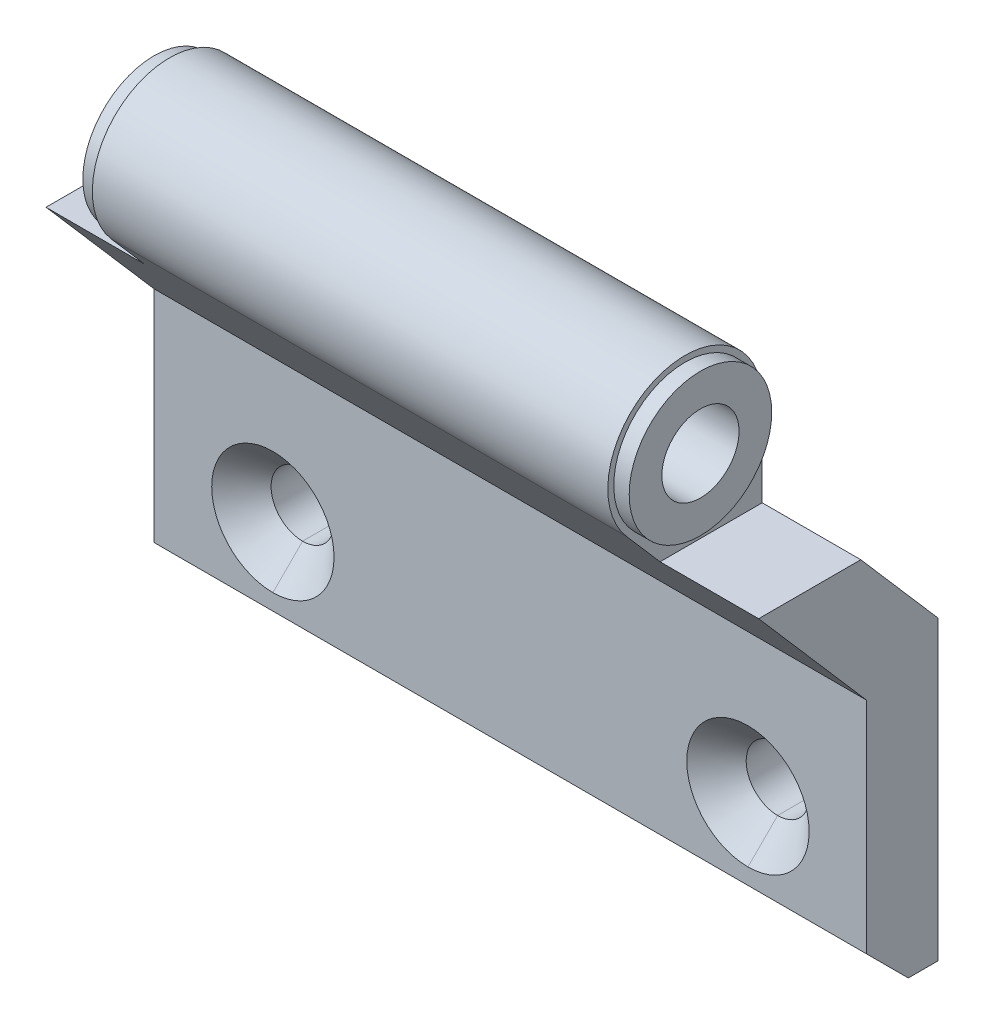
ISO-10303-21;
HEADER;
FILE_DESCRIPTION(('STEP AP214'),'2;1');
FILE_NAME('part.step','',(''),(''),'','','');
FILE_SCHEMA(('AUTOMOTIVE_DESIGN { 1 0 10303 214 1 1 1 1 }'));
ENDSEC;
DATA;
#1=APPLICATION_CONTEXT('core data for automotive mechanical design processes');
#2=APPLICATION_PROTOCOL_DEFINITION('international standard','automotive_design',2000,#1);
#3=PRODUCT_CONTEXT('',#1,'mechanical');
#4=PRODUCT('Part','Part','',(#3));
#5=PRODUCT_RELATED_PRODUCT_CATEGORY('part','',(#4));
#6=PRODUCT_DEFINITION_FORMATION('','',#4);
#7=PRODUCT_DEFINITION_CONTEXT('part definition',#1,'design');
#8=PRODUCT_DEFINITION('design','',#6,#7);
#9=PRODUCT_DEFINITION_SHAPE('','',#8);
#10=(LENGTH_UNIT() NAMED_UNIT(*) SI_UNIT(.MILLI.,.METRE.));
#11=(NAMED_UNIT(*) PLANE_ANGLE_UNIT() SI_UNIT($,.RADIAN.));
#12=(NAMED_UNIT(*) SI_UNIT($,.STERADIAN.) SOLID_ANGLE_UNIT());
#13=UNCERTAINTY_MEASURE_WITH_UNIT(LENGTH_MEASURE(1.E-05),#10,'distance_accuracy_value','');
#14=(GEOMETRIC_REPRESENTATION_CONTEXT(3) GLOBAL_UNCERTAINTY_ASSIGNED_CONTEXT((#13)) GLOBAL_UNIT_ASSIGNED_CONTEXT((#10,
#11,#12)) REPRESENTATION_CONTEXT('',''));
#15=CARTESIAN_POINT('',(0.,0.,0.));
#16=DIRECTION('',(0.,0.,1.));
#17=DIRECTION('',(1.,0.,0.));
#18=AXIS2_PLACEMENT_3D('',#15,#16,#17);
#19=CARTESIAN_POINT('',(-1.7,36.5,6.5));
#20=DIRECTION('',(1.,0.,0.));
#21=DIRECTION('',(0.,-1.,0.));
#22=AXIS2_PLACEMENT_3D('',#19,#20,#21);
#23=PLANE('',#22);
#24=DIRECTION('',(0.,0.755650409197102,0.654975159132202));
#25=VECTOR('',#24,1.);
#26=CARTESIAN_POINT('',(-1.7,12.,6.));
#27=LINE('',#26,#25);
#28=CARTESIAN_POINT('',(-1.7,25.7426614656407,17.9117276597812));
#29=VERTEX_POINT('',#28);
#30=CARTESIAN_POINT('',(-1.7,22.5,15.101085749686));
#31=VERTEX_POINT('',#30);
#32=EDGE_CURVE('E356',#29,#31,#27,.F.);
#33=ORIENTED_EDGE('',*,*,#32,.F.);
#34=CARTESIAN_POINT('',(-1.7,30.,13.));
#35=DIRECTION('',(-1.,0.,0.));
#36=DIRECTION('',(0.,1.,0.));
#37=AXIS2_PLACEMENT_3D('',#34,#35,#36);
#38=CIRCLE('',#37,6.5);
#39=CARTESIAN_POINT('',(-1.7,30.,6.5));
#40=VERTEX_POINT('',#39);
#41=EDGE_CURVE('E254',#40,#29,#38,.F.);
#42=ORIENTED_EDGE('',*,*,#41,.F.);
#43=DIRECTION('',(0.,-1.,0.));
#44=VECTOR('',#43,1.);
#45=CARTESIAN_POINT('',(-1.7,36.5,6.5));
#46=LINE('',#45,#44);
#47=CARTESIAN_POINT('',(-1.7,22.5,6.5));
#48=VERTEX_POINT('',#47);
#49=EDGE_CURVE('E363',#48,#40,#46,.F.);
#50=ORIENTED_EDGE('',*,*,#49,.F.);
#51=DIRECTION('',(0.,0.,-1.));
#52=VECTOR('',#51,1.);
#53=CARTESIAN_POINT('',(-1.7,22.5,6.5));
#54=LINE('',#53,#52);
#55=EDGE_CURVE('E360',#31,#48,#54,.T.);
#56=ORIENTED_EDGE('',*,*,#55,.F.);
#57=EDGE_LOOP('',(#33,#42,#50,#56));
#58=FACE_BOUND('',#57,.T.);
#59=CARTESIAN_POINT('',(-1.7,30.,13.));
#60=DIRECTION('',(1.,0.,0.));
#61=DIRECTION('',(0.,-1.,0.));
#62=AXIS2_PLACEMENT_3D('',#59,#60,#61);
#63=CIRCLE('',#62,6.);
#64=CARTESIAN_POINT('',(-1.7,24.,13.));
#65=VERTEX_POINT('',#64);
#66=EDGE_CURVE('E9',#65,#65,#63,.F.);
#67=ORIENTED_EDGE('',*,*,#66,.F.);
#68=EDGE_LOOP('',(#67));
#69=FACE_BOUND('',#68,.T.);
#70=ADVANCED_FACE('F14',(#58,#69),#23,.F.);
#71=CARTESIAN_POINT('',(41.7,22.5,6.5));
#72=DIRECTION('',(-1.,0.,0.));
#73=DIRECTION('',(0.,1.,0.));
#74=AXIS2_PLACEMENT_3D('',#71,#72,#73);
#75=PLANE('',#74);
#76=DIRECTION('',(0.,0.755650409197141,0.654975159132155));
#77=VECTOR('',#76,1.);
#78=CARTESIAN_POINT('',(41.7,22.5,15.101085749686));
#79=LINE('',#78,#77);
#80=CARTESIAN_POINT('',(41.7,22.5,15.101085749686));
#81=VERTEX_POINT('',#80);
#82=CARTESIAN_POINT('',(41.7,25.742661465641,17.9117276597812));
#83=VERTEX_POINT('',#82);
#84=EDGE_CURVE('E31',#81,#83,#79,.T.);
#85=ORIENTED_EDGE('',*,*,#84,.F.);
#86=DIRECTION('',(0.,0.,-1.));
#87=VECTOR('',#86,1.);
#88=CARTESIAN_POINT('',(41.7,22.5,6.5));
#89=LINE('',#88,#87);
#90=CARTESIAN_POINT('',(41.7,22.5,6.5));
#91=VERTEX_POINT('',#90);
#92=EDGE_CURVE('E344',#91,#81,#89,.F.);
#93=ORIENTED_EDGE('',*,*,#92,.F.);
#94=DIRECTION('',(0.,1.,0.));
#95=VECTOR('',#94,1.);
#96=CARTESIAN_POINT('',(41.7,22.5,6.5));
#97=LINE('',#96,#95);
#98=CARTESIAN_POINT('',(41.7,30.,6.5));
#99=VERTEX_POINT('',#98);
#100=EDGE_CURVE('E347',#99,#91,#97,.F.);
#101=ORIENTED_EDGE('',*,*,#100,.F.);
#102=CARTESIAN_POINT('',(41.7,30.,13.));
#103=DIRECTION('',(-1.,0.,0.));
#104=DIRECTION('',(0.,1.,0.));
#105=AXIS2_PLACEMENT_3D('',#102,#103,#104);
#106=CIRCLE('',#105,6.5);
#107=EDGE_CURVE('E250',#83,#99,#106,.T.);
#108=ORIENTED_EDGE('',*,*,#107,.F.);
#109=EDGE_LOOP('',(#85,#93,#101,#108));
#110=FACE_BOUND('',#109,.T.);
#111=CARTESIAN_POINT('',(41.7,30.,13.));
#112=DIRECTION('',(-1.,0.,0.));
#113=DIRECTION('',(0.,1.,0.));
#114=AXIS2_PLACEMENT_3D('',#111,#112,#113);
#115=CIRCLE('',#114,6.);
#116=CARTESIAN_POINT('',(41.7,36.,13.));
#117=VERTEX_POINT('',#116);
#118=EDGE_CURVE('E23',#117,#117,#115,.F.);
#119=ORIENTED_EDGE('',*,*,#118,.F.);
#120=EDGE_LOOP('',(#119));
#121=FACE_BOUND('',#120,.T.);
#122=ADVANCED_FACE('F283',(#110,#121),#75,.F.);
#123=CARTESIAN_POINT('',(50.,-6.5,13.));
#124=DIRECTION('',(0.,-1.,0.));
#125=DIRECTION('',(-1.,0.,0.));
#126=AXIS2_PLACEMENT_3D('',#123,#124,#125);
#127=PLANE('',#126);
#128=DIRECTION('',(1.,0.,0.));
#129=VECTOR('',#128,1.);
#130=CARTESIAN_POINT('',(33.,-6.5,3.5));
#131=LINE('',#130,#129);
#132=CARTESIAN_POINT('',(7.,-6.5,3.5));
#133=VERTEX_POINT('',#132);
#134=CARTESIAN_POINT('',(33.,-6.5,3.5));
#135=VERTEX_POINT('',#134);
#136=EDGE_CURVE('E214',#133,#135,#131,.T.);
#137=ORIENTED_EDGE('',*,*,#136,.T.);
#138=DIRECTION('',(0.,0.,-1.));
#139=VECTOR('',#138,1.);
#140=CARTESIAN_POINT('',(33.,-6.5,0.));
#141=LINE('',#140,#139);
#142=CARTESIAN_POINT('',(33.,-6.5,0.));
#143=VERTEX_POINT('',#142);
#144=EDGE_CURVE('E127',#135,#143,#141,.T.);
#145=ORIENTED_EDGE('',*,*,#144,.T.);
#146=DIRECTION('',(-1.,0.,0.));
#147=VECTOR('',#146,1.);
#148=CARTESIAN_POINT('',(50.,-6.5,0.));
#149=LINE('',#148,#147);
#150=CARTESIAN_POINT('',(7.,-6.5,0.));
#151=VERTEX_POINT('',#150);
#152=EDGE_CURVE('E189',#151,#143,#149,.F.);
#153=ORIENTED_EDGE('',*,*,#152,.F.);
#154=DIRECTION('',(0.,0.,-1.));
#155=VECTOR('',#154,1.);
#156=CARTESIAN_POINT('',(7.,-6.5,3.5));
#157=LINE('',#156,#155);
#158=EDGE_CURVE('E82',#151,#133,#157,.F.);
#159=ORIENTED_EDGE('',*,*,#158,.T.);
#160=EDGE_LOOP('',(#137,#145,#153,#159));
#161=FACE_BOUND('',#160,.T.);
#162=ADVANCED_FACE('F16',(#161),#127,.F.);
#163=CARTESIAN_POINT('',(40.,0.,6.3));
#164=DIRECTION('',(0.,0.,-1.));
#165=DIRECTION('',(-1.,0.,0.));
#166=AXIS2_PLACEMENT_3D('',#163,#164,#165);
#167=CYLINDRICAL_SURFACE('',#166,2.65);
#168=CARTESIAN_POINT('',(40.,0.,3.49999999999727));
#169=DIRECTION('',(0.,0.,1.));
#170=DIRECTION('',(0.,-1.,0.));
#171=AXIS2_PLACEMENT_3D('',#168,#169,#170);
#172=CIRCLE('',#171,2.64999999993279);
#173=CARTESIAN_POINT('',(40.,2.6499999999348,3.49999999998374));
#174=VERTEX_POINT('',#173);
#175=CARTESIAN_POINT('',(40.,-2.6499999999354,3.49999999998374));
#176=VERTEX_POINT('',#175);
#177=EDGE_CURVE('E103',#174,#176,#172,.T.);
#178=ORIENTED_EDGE('',*,*,#177,.T.);
#179=DIRECTION('',(0.,0.,-1.));
#180=VECTOR('',#179,1.);
#181=CARTESIAN_POINT('',(40.,-2.65,6.3));
#182=LINE('',#181,#180);
#183=CARTESIAN_POINT('',(40.,-2.65,0.));
#184=VERTEX_POINT('',#183);
#185=EDGE_CURVE('E111',#176,#184,#182,.T.);
#186=ORIENTED_EDGE('',*,*,#185,.T.);
#187=CARTESIAN_POINT('',(40.,0.,0.));
#188=DIRECTION('',(0.,0.,-1.));
#189=DIRECTION('',(-1.,0.,0.));
#190=AXIS2_PLACEMENT_3D('',#187,#188,#189);
#191=CIRCLE('',#190,2.65);
#192=CARTESIAN_POINT('',(40.,2.65,0.));
#193=VERTEX_POINT('',#192);
#194=EDGE_CURVE('E73',#193,#184,#191,.F.);
#195=ORIENTED_EDGE('',*,*,#194,.F.);
#196=DIRECTION('',(0.,0.,-1.));
#197=VECTOR('',#196,1.);
#198=CARTESIAN_POINT('',(40.,2.65,6.3));
#199=LINE('',#198,#197);
#200=EDGE_CURVE('E105',#193,#174,#199,.F.);
#201=ORIENTED_EDGE('',*,*,#200,.T.);
#202=EDGE_LOOP('',(#178,#186,#195,#201));
#203=FACE_BOUND('',#202,.T.);
#204=ADVANCED_FACE('F107',(#203),#167,.F.);
#205=CARTESIAN_POINT('',(40.,0.,6.3));
#206=DIRECTION('',(0.,0.,-1.));
#207=DIRECTION('',(-1.,0.,0.));
#208=AXIS2_PLACEMENT_3D('',#205,#206,#207);
#209=CYLINDRICAL_SURFACE('',#208,2.65);
#210=CARTESIAN_POINT('',(40.,0.,3.49999999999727));
#211=DIRECTION('',(0.,0.,1.));
#212=DIRECTION('',(0.,-1.,0.));
#213=AXIS2_PLACEMENT_3D('',#210,#211,#212);
#214=CIRCLE('',#213,2.64999999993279);
#215=EDGE_CURVE('E116',#176,#174,#214,.T.);
#216=ORIENTED_EDGE('',*,*,#215,.T.);
#217=ORIENTED_EDGE('',*,*,#200,.F.);
#218=CARTESIAN_POINT('',(40.,0.,0.));
#219=DIRECTION('',(0.,0.,-1.));
#220=DIRECTION('',(-1.,0.,0.));
#221=AXIS2_PLACEMENT_3D('',#218,#219,#220);
#222=CIRCLE('',#221,2.65);
#223=EDGE_CURVE('E276',#184,#193,#222,.F.);
#224=ORIENTED_EDGE('',*,*,#223,.F.);
#225=ORIENTED_EDGE('',*,*,#185,.F.);
#226=EDGE_LOOP('',(#216,#217,#224,#225));
#227=FACE_BOUND('',#226,.T.);
#228=ADVANCED_FACE('F117',(#227),#209,.F.);
#229=CARTESIAN_POINT('',(0.,0.,6.3));
#230=DIRECTION('',(0.,0.,1.));
#231=DIRECTION('',(1.,0.,0.));
#232=AXIS2_PLACEMENT_3D('',#229,#230,#231);
#233=CYLINDRICAL_SURFACE('',#232,2.65);
#234=CARTESIAN_POINT('',(0.,0.,3.50000000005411));
#235=DIRECTION('',(0.,0.,1.));
#236=DIRECTION('',(0.,1.,0.));
#237=AXIS2_PLACEMENT_3D('',#234,#235,#236);
#238=CIRCLE('',#237,2.64999999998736);
#239=CARTESIAN_POINT('',(0.,-2.6499999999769,3.50000000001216));
#240=VERTEX_POINT('',#239);
#241=CARTESIAN_POINT('',(0.,2.6499999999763,3.50000000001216));
#242=VERTEX_POINT('',#241);
#243=EDGE_CURVE('E133',#240,#242,#238,.T.);
#244=ORIENTED_EDGE('',*,*,#243,.T.);
#245=DIRECTION('',(0.,0.,1.));
#246=VECTOR('',#245,1.);
#247=CARTESIAN_POINT('',(0.,2.65,6.3));
#248=LINE('',#247,#246);
#249=CARTESIAN_POINT('',(0.,2.65,0.));
#250=VERTEX_POINT('',#249);
#251=EDGE_CURVE('E212',#242,#250,#248,.F.);
#252=ORIENTED_EDGE('',*,*,#251,.T.);
#253=CARTESIAN_POINT('',(0.,0.,0.));
#254=DIRECTION('',(0.,0.,1.));
#255=DIRECTION('',(1.,0.,0.));
#256=AXIS2_PLACEMENT_3D('',#253,#254,#255);
#257=CIRCLE('',#256,2.65);
#258=CARTESIAN_POINT('',(0.,-2.65,0.));
#259=VERTEX_POINT('',#258);
#260=EDGE_CURVE('E273',#259,#250,#257,.T.);
#261=ORIENTED_EDGE('',*,*,#260,.F.);
#262=DIRECTION('',(0.,0.,1.));
#263=VECTOR('',#262,1.);
#264=CARTESIAN_POINT('',(0.,-2.65,6.3));
#265=LINE('',#264,#263);
#266=EDGE_CURVE('E215',#259,#240,#265,.T.);
#267=ORIENTED_EDGE('',*,*,#266,.T.);
#268=EDGE_LOOP('',(#244,#252,#261,#267));
#269=FACE_BOUND('',#268,.T.);
#270=ADVANCED_FACE('F623',(#269),#233,.F.);
#271=CARTESIAN_POINT('',(0.,0.,6.3));
#272=DIRECTION('',(0.,0.,1.));
#273=DIRECTION('',(1.,0.,0.));
#274=AXIS2_PLACEMENT_3D('',#271,#272,#273);
#275=CYLINDRICAL_SURFACE('',#274,2.65);
#276=CARTESIAN_POINT('',(0.,0.,3.50000000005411));
#277=DIRECTION('',(0.,0.,1.));
#278=DIRECTION('',(0.,1.,0.));
#279=AXIS2_PLACEMENT_3D('',#276,#277,#278);
#280=CIRCLE('',#279,2.64999999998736);
#281=EDGE_CURVE('E238',#242,#240,#280,.T.);
#282=ORIENTED_EDGE('',*,*,#281,.T.);
#283=ORIENTED_EDGE('',*,*,#266,.F.);
#284=CARTESIAN_POINT('',(0.,0.,0.));
#285=DIRECTION('',(0.,0.,1.));
#286=DIRECTION('',(1.,0.,0.));
#287=AXIS2_PLACEMENT_3D('',#284,#285,#286);
#288=CIRCLE('',#287,2.65);
#289=EDGE_CURVE('E269',#250,#259,#288,.T.);
#290=ORIENTED_EDGE('',*,*,#289,.F.);
#291=ORIENTED_EDGE('',*,*,#251,.F.);
#292=EDGE_LOOP('',(#282,#283,#290,#291));
#293=FACE_BOUND('',#292,.T.);
#294=ADVANCED_FACE('F479',(#293),#275,.F.);
#295=CARTESIAN_POINT('',(33.,-6.5,3.5));
#296=DIRECTION('',(0.,0.,1.));
#297=DIRECTION('',(1.,0.,0.));
#298=AXIS2_PLACEMENT_3D('',#295,#296,#297);
#299=PLANE('',#298);
#300=ORIENTED_EDGE('',*,*,#136,.F.);
#301=DIRECTION('',(0.,1.,0.));
#302=VECTOR('',#301,1.);
#303=CARTESIAN_POINT('',(7.,-6.5,3.5));
#304=LINE('',#303,#302);
#305=CARTESIAN_POINT('',(7.,19.0384615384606,3.49999999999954));
#306=VERTEX_POINT('',#305);
#307=EDGE_CURVE('E197',#133,#306,#304,.T.);
#308=ORIENTED_EDGE('',*,*,#307,.T.);
#309=DIRECTION('',(-1.,0.,0.));
#310=VECTOR('',#309,1.);
#311=CARTESIAN_POINT('',(50.,19.0384615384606,3.49999999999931));
#312=LINE('',#311,#310);
#313=CARTESIAN_POINT('',(33.,19.0384615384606,3.49999999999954));
#314=VERTEX_POINT('',#313);
#315=EDGE_CURVE('E194',#314,#306,#312,.T.);
#316=ORIENTED_EDGE('',*,*,#315,.F.);
#317=DIRECTION('',(0.,-1.,0.));
#318=VECTOR('',#317,1.);
#319=CARTESIAN_POINT('',(33.,-6.5,3.5));
#320=LINE('',#319,#318);
#321=EDGE_CURVE('E200',#314,#135,#320,.T.);
#322=ORIENTED_EDGE('',*,*,#321,.T.);
#323=EDGE_LOOP('',(#300,#308,#316,#322));
#324=FACE_BOUND('',#323,.T.);
#325=ADVANCED_FACE('F548',(#324),#299,.F.);
#326=CARTESIAN_POINT('',(7.,-6.5,3.5));
#327=DIRECTION('',(-1.,0.,0.));
#328=DIRECTION('',(0.,1.,0.));
#329=AXIS2_PLACEMENT_3D('',#326,#327,#328);
#330=PLANE('',#329);
#331=ORIENTED_EDGE('',*,*,#158,.F.);
#332=DIRECTION('',(0.,1.,0.));
#333=VECTOR('',#332,1.);
#334=CARTESIAN_POINT('',(7.,15.,0.));
#335=LINE('',#334,#333);
#336=CARTESIAN_POINT('',(7.,15.,0.));
#337=VERTEX_POINT('',#336);
#338=EDGE_CURVE('E178',#337,#151,#335,.F.);
#339=ORIENTED_EDGE('',*,*,#338,.F.);
#340=DIRECTION('',(0.,-0.755689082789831,-0.654930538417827));
#341=VECTOR('',#340,1.);
#342=CARTESIAN_POINT('',(7.,22.5,6.5));
#343=LINE('',#342,#341);
#344=EDGE_CURVE('E172',#306,#337,#343,.T.);
#345=ORIENTED_EDGE('',*,*,#344,.F.);
#346=ORIENTED_EDGE('',*,*,#307,.F.);
#347=EDGE_LOOP('',(#331,#339,#345,#346));
#348=FACE_BOUND('',#347,.T.);
#349=ADVANCED_FACE('F549',(#348),#330,.F.);
#350=CARTESIAN_POINT('',(33.,-6.5,0.));
#351=DIRECTION('',(1.,0.,0.));
#352=DIRECTION('',(0.,-1.,0.));
#353=AXIS2_PLACEMENT_3D('',#350,#351,#352);
#354=PLANE('',#353);
#355=ORIENTED_EDGE('',*,*,#144,.F.);
#356=ORIENTED_EDGE('',*,*,#321,.F.);
#357=DIRECTION('',(0.,-0.755689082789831,-0.654930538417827));
#358=VECTOR('',#357,1.);
#359=CARTESIAN_POINT('',(33.,22.5,6.5));
#360=LINE('',#359,#358);
#361=CARTESIAN_POINT('',(33.,15.,0.));
#362=VERTEX_POINT('',#361);
#363=EDGE_CURVE('E182',#362,#314,#360,.F.);
#364=ORIENTED_EDGE('',*,*,#363,.F.);
#365=DIRECTION('',(0.,1.,0.));
#366=VECTOR('',#365,1.);
#367=CARTESIAN_POINT('',(33.,15.,0.));
#368=LINE('',#367,#366);
#369=EDGE_CURVE('E175',#143,#362,#368,.T.);
#370=ORIENTED_EDGE('',*,*,#369,.F.);
#371=EDGE_LOOP('',(#355,#356,#364,#370));
#372=FACE_BOUND('',#371,.T.);
#373=ADVANCED_FACE('F557',(#372),#354,.F.);
#374=CARTESIAN_POINT('',(40.,0.,5.99999999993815));
#375=DIRECTION('',(0.,0.,1.));
#376=DIRECTION('',(1.,0.,0.));
#377=AXIS2_PLACEMENT_3D('',#374,#375,#376);
#378=CONICAL_SURFACE('',#377,5.14999999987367,0.785398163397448);
#379=ORIENTED_EDGE('',*,*,#177,.F.);
#380=DIRECTION('',(0.,-0.707106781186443,-0.707106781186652));
#381=VECTOR('',#380,1.);
#382=CARTESIAN_POINT('',(40.0000000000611,498970.,498970.850000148));
#383=LINE('',#382,#381);
#384=CARTESIAN_POINT('',(40.,5.1499999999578,5.999999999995));
#385=VERTEX_POINT('',#384);
#386=EDGE_CURVE('E121',#174,#385,#383,.F.);
#387=ORIENTED_EDGE('',*,*,#386,.T.);
#388=CARTESIAN_POINT('',(40.,0.,5.999999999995));
#389=DIRECTION('',(0.,0.,1.));
#390=DIRECTION('',(1.,0.,0.));
#391=AXIS2_PLACEMENT_3D('',#388,#389,#390);
#392=CIRCLE('',#391,5.14999999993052);
#393=CARTESIAN_POINT('',(40.,-5.14999999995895,5.999999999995));
#394=VERTEX_POINT('',#393);
#395=EDGE_CURVE('E266',#394,#385,#392,.F.);
#396=ORIENTED_EDGE('',*,*,#395,.F.);
#397=DIRECTION('',(0.,0.707106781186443,-0.707106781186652));
#398=VECTOR('',#397,1.);
#399=CARTESIAN_POINT('',(40.,-498970.,498970.850000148));
#400=LINE('',#399,#398);
#401=EDGE_CURVE('E122',#394,#176,#400,.T.);
#402=ORIENTED_EDGE('',*,*,#401,.T.);
#403=EDGE_LOOP('',(#379,#387,#396,#402));
#404=FACE_BOUND('',#403,.T.);
#405=ADVANCED_FACE('F125',(#404),#378,.F.);
#406=CARTESIAN_POINT('',(40.,0.,5.99999999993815));
#407=DIRECTION('',(0.,0.,1.));
#408=DIRECTION('',(1.,0.,0.));
#409=AXIS2_PLACEMENT_3D('',#406,#407,#408);
#410=CONICAL_SURFACE('',#409,5.14999999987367,0.785398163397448);
#411=ORIENTED_EDGE('',*,*,#215,.F.);
#412=ORIENTED_EDGE('',*,*,#401,.F.);
#413=CARTESIAN_POINT('',(40.,0.,5.999999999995));
#414=DIRECTION('',(0.,0.,1.));
#415=DIRECTION('',(1.,0.,0.));
#416=AXIS2_PLACEMENT_3D('',#413,#414,#415);
#417=CIRCLE('',#416,5.14999999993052);
#418=EDGE_CURVE('E131',#385,#394,#417,.F.);
#419=ORIENTED_EDGE('',*,*,#418,.F.);
#420=ORIENTED_EDGE('',*,*,#386,.F.);
#421=EDGE_LOOP('',(#411,#412,#419,#420));
#422=FACE_BOUND('',#421,.T.);
#423=ADVANCED_FACE('F129',(#422),#410,.F.);
#424=CARTESIAN_POINT('',(0.,0.,5.999999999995));
#425=DIRECTION('',(0.,0.,1.));
#426=DIRECTION('',(1.,0.,0.));
#427=AXIS2_PLACEMENT_3D('',#424,#425,#426);
#428=CONICAL_SURFACE('',#427,5.14999999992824,0.78539816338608);
#429=ORIENTED_EDGE('',*,*,#243,.F.);
#430=DIRECTION('',(0.,0.707106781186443,-0.707106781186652));
#431=VECTOR('',#430,1.);
#432=CARTESIAN_POINT('',(-6.10969608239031E-11,-499012.149999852,499013.));
#433=LINE('',#432,#431);
#434=CARTESIAN_POINT('',(0.,-5.15000000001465,6.00000000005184));
#435=VERTEX_POINT('',#434);
#436=EDGE_CURVE('E179',#240,#435,#433,.F.);
#437=ORIENTED_EDGE('',*,*,#436,.T.);
#438=CARTESIAN_POINT('',(0.,0.,6.00000000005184));
#439=DIRECTION('',(0.,0.,1.));
#440=DIRECTION('',(1.,0.,0.));
#441=AXIS2_PLACEMENT_3D('',#438,#439,#440);
#442=CIRCLE('',#441,5.14999999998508);
#443=CARTESIAN_POINT('',(0.,5.1500000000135,6.00000000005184));
#444=VERTEX_POINT('',#443);
#445=EDGE_CURVE('E262',#444,#435,#442,.F.);
#446=ORIENTED_EDGE('',*,*,#445,.F.);
#447=DIRECTION('',(0.,-0.707106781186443,-0.707106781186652));
#448=VECTOR('',#447,1.);
#449=CARTESIAN_POINT('',(0.,499012.149999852,499013.));
#450=LINE('',#449,#448);
#451=EDGE_CURVE('E135',#444,#242,#450,.T.);
#452=ORIENTED_EDGE('',*,*,#451,.T.);
#453=EDGE_LOOP('',(#429,#437,#446,#452));
#454=FACE_BOUND('',#453,.T.);
#455=ADVANCED_FACE('F472',(#454),#428,.F.);
#456=CARTESIAN_POINT('',(0.,0.,5.999999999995));
#457=DIRECTION('',(0.,0.,1.));
#458=DIRECTION('',(1.,0.,0.));
#459=AXIS2_PLACEMENT_3D('',#456,#457,#458);
#460=CONICAL_SURFACE('',#459,5.14999999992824,0.78539816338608);
#461=ORIENTED_EDGE('',*,*,#281,.F.);
#462=ORIENTED_EDGE('',*,*,#451,.F.);
#463=CARTESIAN_POINT('',(0.,0.,6.00000000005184));
#464=DIRECTION('',(0.,0.,1.));
#465=DIRECTION('',(1.,0.,0.));
#466=AXIS2_PLACEMENT_3D('',#463,#464,#465);
#467=CIRCLE('',#466,5.14999999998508);
#468=EDGE_CURVE('E258',#435,#444,#467,.F.);
#469=ORIENTED_EDGE('',*,*,#468,.F.);
#470=ORIENTED_EDGE('',*,*,#436,.F.);
#471=EDGE_LOOP('',(#461,#462,#469,#470));
#472=FACE_BOUND('',#471,.T.);
#473=ADVANCED_FACE('F482',(#472),#460,.F.);
#474=CARTESIAN_POINT('',(50.,15.,0.));
#475=DIRECTION('',(0.,0.,-1.));
#476=DIRECTION('',(-1.,0.,0.));
#477=AXIS2_PLACEMENT_3D('',#474,#475,#476);
#478=PLANE('',#477);
#479=ORIENTED_EDGE('',*,*,#260,.T.);
#480=ORIENTED_EDGE('',*,*,#289,.T.);
#481=EDGE_LOOP('',(#479,#480));
#482=FACE_BOUND('',#481,.T.);
#483=ORIENTED_EDGE('',*,*,#194,.T.);
#484=ORIENTED_EDGE('',*,*,#223,.T.);
#485=EDGE_LOOP('',(#483,#484));
#486=FACE_BOUND('',#485,.T.);
#487=ORIENTED_EDGE('',*,*,#338,.T.);
#488=ORIENTED_EDGE('',*,*,#152,.T.);
#489=ORIENTED_EDGE('',*,*,#369,.T.);
#490=DIRECTION('',(-1.,0.,0.));
#491=VECTOR('',#490,1.);
#492=CARTESIAN_POINT('',(50.,15.,1.59594559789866E-13));
#493=LINE('',#492,#491);
#494=CARTESIAN_POINT('',(50.,15.,0.));
#495=VERTEX_POINT('',#494);
#496=EDGE_CURVE('E171',#495,#362,#493,.T.);
#497=ORIENTED_EDGE('',*,*,#496,.F.);
#498=DIRECTION('',(0.,1.,0.));
#499=VECTOR('',#498,1.);
#500=CARTESIAN_POINT('',(50.,30.,0.));
#501=LINE('',#500,#499);
#502=CARTESIAN_POINT('',(50.,-10.,0.));
#503=VERTEX_POINT('',#502);
#504=EDGE_CURVE('E433',#495,#503,#501,.F.);
#505=ORIENTED_EDGE('',*,*,#504,.T.);
#506=DIRECTION('',(-1.,0.,0.));
#507=VECTOR('',#506,1.);
#508=CARTESIAN_POINT('',(50.,-10.,0.));
#509=LINE('',#508,#507);
#510=CARTESIAN_POINT('',(-10.,-10.,0.));
#511=VERTEX_POINT('',#510);
#512=EDGE_CURVE('E272',#511,#503,#509,.F.);
#513=ORIENTED_EDGE('',*,*,#512,.F.);
#514=DIRECTION('',(0.,1.,0.));
#515=VECTOR('',#514,1.);
#516=CARTESIAN_POINT('',(-10.,30.,0.));
#517=LINE('',#516,#515);
#518=CARTESIAN_POINT('',(-10.,15.,0.));
#519=VERTEX_POINT('',#518);
#520=EDGE_CURVE('E156',#519,#511,#517,.F.);
#521=ORIENTED_EDGE('',*,*,#520,.F.);
#522=DIRECTION('',(-1.,0.,0.));
#523=VECTOR('',#522,1.);
#524=CARTESIAN_POINT('',(50.,15.,1.59594559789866E-13));
#525=LINE('',#524,#523);
#526=EDGE_CURVE('E168',#337,#519,#525,.T.);
#527=ORIENTED_EDGE('',*,*,#526,.F.);
#528=EDGE_LOOP('',(#487,#488,#489,#497,#505,#513,#521,#527));
#529=FACE_BOUND('',#528,.T.);
#530=ADVANCED_FACE('F559',(#482,#486,#529),#478,.T.);
#531=CARTESIAN_POINT('',(50.,-10.,0.));
#532=DIRECTION('',(0.,-1.,0.));
#533=DIRECTION('',(-1.,0.,0.));
#534=AXIS2_PLACEMENT_3D('',#531,#532,#533);
#535=PLANE('',#534);
#536=ORIENTED_EDGE('',*,*,#512,.T.);
#537=DIRECTION('',(0.,0.,-1.));
#538=VECTOR('',#537,1.);
#539=CARTESIAN_POINT('',(50.,-10.,13.));
#540=LINE('',#539,#538);
#541=CARTESIAN_POINT('',(50.,-10.,2.5));
#542=VERTEX_POINT('',#541);
#543=EDGE_CURVE('E442',#503,#542,#540,.F.);
#544=ORIENTED_EDGE('',*,*,#543,.T.);
#545=DIRECTION('',(-1.,0.,0.));
#546=VECTOR('',#545,1.);
#547=CARTESIAN_POINT('',(50.,-10.,2.5));
#548=LINE('',#547,#546);
#549=CARTESIAN_POINT('',(-10.,-10.,2.5));
#550=VERTEX_POINT('',#549);
#551=EDGE_CURVE('E205',#550,#542,#548,.F.);
#552=ORIENTED_EDGE('',*,*,#551,.F.);
#553=DIRECTION('',(0.,0.,-1.));
#554=VECTOR('',#553,1.);
#555=CARTESIAN_POINT('',(-10.,-10.,13.));
#556=LINE('',#555,#554);
#557=EDGE_CURVE('E150',#511,#550,#556,.F.);
#558=ORIENTED_EDGE('',*,*,#557,.F.);
#559=EDGE_LOOP('',(#536,#544,#552,#558));
#560=FACE_BOUND('',#559,.T.);
#561=ADVANCED_FACE('F600',(#560),#535,.T.);
#562=CARTESIAN_POINT('',(50.,-6.5,6.));
#563=DIRECTION('',(0.,-0.707106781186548,0.707106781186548));
#564=DIRECTION('',(0.,0.707106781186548,0.707106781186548));
#565=AXIS2_PLACEMENT_3D('',#562,#563,#564);
#566=PLANE('',#565);
#567=DIRECTION('',(0.,0.707106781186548,0.707106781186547));
#568=VECTOR('',#567,1.);
#569=CARTESIAN_POINT('',(50.,-10.,2.5));
#570=LINE('',#569,#568);
#571=CARTESIAN_POINT('',(50.,-6.5,6.));
#572=VERTEX_POINT('',#571);
#573=EDGE_CURVE('E398',#542,#572,#570,.T.);
#574=ORIENTED_EDGE('',*,*,#573,.T.);
#575=DIRECTION('',(1.,0.,0.));
#576=VECTOR('',#575,1.);
#577=CARTESIAN_POINT('',(50.,-6.5,6.));
#578=LINE('',#577,#576);
#579=CARTESIAN_POINT('',(-10.,-6.5,6.));
#580=VERTEX_POINT('',#579);
#581=EDGE_CURVE('E268',#580,#572,#578,.T.);
#582=ORIENTED_EDGE('',*,*,#581,.F.);
#583=DIRECTION('',(0.,0.707106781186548,0.707106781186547));
#584=VECTOR('',#583,1.);
#585=CARTESIAN_POINT('',(-10.,-10.,2.5));
#586=LINE('',#585,#584);
#587=EDGE_CURVE('E146',#550,#580,#586,.T.);
#588=ORIENTED_EDGE('',*,*,#587,.F.);
#589=ORIENTED_EDGE('',*,*,#551,.T.);
#590=EDGE_LOOP('',(#574,#582,#588,#589));
#591=FACE_BOUND('',#590,.T.);
#592=ADVANCED_FACE('F597',(#591),#566,.T.);
#593=CARTESIAN_POINT('',(50.,22.5,6.5));
#594=DIRECTION('',(0.,0.654930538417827,-0.755689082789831));
#595=DIRECTION('',(0.,-0.755689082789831,-0.654930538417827));
#596=AXIS2_PLACEMENT_3D('',#593,#594,#595);
#597=PLANE('',#596);
#598=ORIENTED_EDGE('',*,*,#496,.T.);
#599=ORIENTED_EDGE('',*,*,#363,.T.);
#600=ORIENTED_EDGE('',*,*,#315,.T.);
#601=ORIENTED_EDGE('',*,*,#344,.T.);
#602=ORIENTED_EDGE('',*,*,#526,.T.);
#603=DIRECTION('',(0.,-0.755689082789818,-0.654930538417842));
#604=VECTOR('',#603,1.);
#605=CARTESIAN_POINT('',(-10.,22.5,6.5));
#606=LINE('',#605,#604);
#607=CARTESIAN_POINT('',(-10.,22.5,6.5));
#608=VERTEX_POINT('',#607);
#609=EDGE_CURVE('E153',#608,#519,#606,.T.);
#610=ORIENTED_EDGE('',*,*,#609,.F.);
#611=DIRECTION('',(-1.,0.,0.));
#612=VECTOR('',#611,1.);
#613=CARTESIAN_POINT('',(-1.7,22.5,6.5));
#614=LINE('',#613,#612);
#615=EDGE_CURVE('E157',#608,#48,#614,.F.);
#616=ORIENTED_EDGE('',*,*,#615,.T.);
#617=DIRECTION('',(-1.,0.,0.));
#618=VECTOR('',#617,1.);
#619=CARTESIAN_POINT('',(50.,22.5,6.5));
#620=LINE('',#619,#618);
#621=EDGE_CURVE('E365',#91,#48,#620,.T.);
#622=ORIENTED_EDGE('',*,*,#621,.F.);
#623=DIRECTION('',(-1.,0.,0.));
#624=VECTOR('',#623,1.);
#625=CARTESIAN_POINT('',(50.,22.5,6.5));
#626=LINE('',#625,#624);
#627=CARTESIAN_POINT('',(50.,22.5,6.5));
#628=VERTEX_POINT('',#627);
#629=EDGE_CURVE('E376',#91,#628,#626,.F.);
#630=ORIENTED_EDGE('',*,*,#629,.T.);
#631=DIRECTION('',(0.,-0.755689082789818,-0.654930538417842));
#632=VECTOR('',#631,1.);
#633=CARTESIAN_POINT('',(50.,22.5,6.5));
#634=LINE('',#633,#632);
#635=EDGE_CURVE('E261',#628,#495,#634,.T.);
#636=ORIENTED_EDGE('',*,*,#635,.T.);
#637=EDGE_LOOP('',(#598,#599,#600,#601,#602,#610,#616,#622,#630,#636));
#638=FACE_BOUND('',#637,.T.);
#639=ADVANCED_FACE('F552',(#638),#597,.T.);
#640=CARTESIAN_POINT('',(-1.7,22.5,6.5));
#641=DIRECTION('',(0.,-1.,0.));
#642=DIRECTION('',(-1.,0.,0.));
#643=AXIS2_PLACEMENT_3D('',#640,#641,#642);
#644=PLANE('',#643);
#645=ORIENTED_EDGE('',*,*,#55,.T.);
#646=ORIENTED_EDGE('',*,*,#615,.F.);
#647=DIRECTION('',(0.,0.,-1.));
#648=VECTOR('',#647,1.);
#649=CARTESIAN_POINT('',(-10.,22.5,13.));
#650=LINE('',#649,#648);
#651=CARTESIAN_POINT('',(-10.,22.5,15.101085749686));
#652=VERTEX_POINT('',#651);
#653=EDGE_CURVE('E149',#652,#608,#650,.T.);
#654=ORIENTED_EDGE('',*,*,#653,.F.);
#655=DIRECTION('',(-1.,0.,0.));
#656=VECTOR('',#655,1.);
#657=CARTESIAN_POINT('',(50.,22.5,15.101085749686));
#658=LINE('',#657,#656);
#659=EDGE_CURVE('E359',#31,#652,#658,.T.);
#660=ORIENTED_EDGE('',*,*,#659,.F.);
#661=EDGE_LOOP('',(#645,#646,#654,#660));
#662=FACE_BOUND('',#661,.T.);
#663=ADVANCED_FACE('F564',(#662),#644,.F.);
#664=CARTESIAN_POINT('',(-10.,30.,13.));
#665=DIRECTION('',(-1.,0.,0.));
#666=DIRECTION('',(0.,1.,0.));
#667=AXIS2_PLACEMENT_3D('',#664,#665,#666);
#668=PLANE('',#667);
#669=DIRECTION('',(0.,0.755650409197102,0.654975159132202));
#670=VECTOR('',#669,1.);
#671=CARTESIAN_POINT('',(-10.,12.,6.));
#672=LINE('',#671,#670);
#673=CARTESIAN_POINT('',(-10.,12.,6.));
#674=VERTEX_POINT('',#673);
#675=EDGE_CURVE('E403',#652,#674,#672,.F.);
#676=ORIENTED_EDGE('',*,*,#675,.F.);
#677=ORIENTED_EDGE('',*,*,#653,.T.);
#678=ORIENTED_EDGE('',*,*,#609,.T.);
#679=ORIENTED_EDGE('',*,*,#520,.T.);
#680=ORIENTED_EDGE('',*,*,#557,.T.);
#681=ORIENTED_EDGE('',*,*,#587,.T.);
#682=DIRECTION('',(0.,1.,0.));
#683=VECTOR('',#682,1.);
#684=CARTESIAN_POINT('',(-10.,-10.,6.));
#685=LINE('',#684,#683);
#686=EDGE_CURVE('E406',#674,#580,#685,.F.);
#687=ORIENTED_EDGE('',*,*,#686,.F.);
#688=EDGE_LOOP('',(#676,#677,#678,#679,#680,#681,#687));
#689=FACE_BOUND('',#688,.T.);
#690=ADVANCED_FACE('F488',(#689),#668,.T.);
#691=CARTESIAN_POINT('',(50.,-10.,6.));
#692=DIRECTION('',(0.,0.,1.));
#693=DIRECTION('',(1.,0.,0.));
#694=AXIS2_PLACEMENT_3D('',#691,#692,#693);
#695=PLANE('',#694);
#696=ORIENTED_EDGE('',*,*,#445,.T.);
#697=ORIENTED_EDGE('',*,*,#468,.T.);
#698=EDGE_LOOP('',(#696,#697));
#699=FACE_BOUND('',#698,.T.);
#700=ORIENTED_EDGE('',*,*,#395,.T.);
#701=ORIENTED_EDGE('',*,*,#418,.T.);
#702=EDGE_LOOP('',(#700,#701));
#703=FACE_BOUND('',#702,.T.);
#704=ORIENTED_EDGE('',*,*,#581,.T.);
#705=DIRECTION('',(0.,1.,0.));
#706=VECTOR('',#705,1.);
#707=CARTESIAN_POINT('',(50.,30.,6.));
#708=LINE('',#707,#706);
#709=CARTESIAN_POINT('',(50.,12.,6.));
#710=VERTEX_POINT('',#709);
#711=EDGE_CURVE('E388',#572,#710,#708,.T.);
#712=ORIENTED_EDGE('',*,*,#711,.T.);
#713=DIRECTION('',(-1.,0.,0.));
#714=VECTOR('',#713,1.);
#715=CARTESIAN_POINT('',(50.,12.,6.));
#716=LINE('',#715,#714);
#717=EDGE_CURVE('E393',#674,#710,#716,.F.);
#718=ORIENTED_EDGE('',*,*,#717,.F.);
#719=ORIENTED_EDGE('',*,*,#686,.T.);
#720=EDGE_LOOP('',(#704,#712,#718,#719));
#721=FACE_BOUND('',#720,.T.);
#722=ADVANCED_FACE('F484',(#699,#703,#721),#695,.T.);
#723=CARTESIAN_POINT('',(50.,30.,13.));
#724=DIRECTION('',(-1.,0.,0.));
#725=DIRECTION('',(0.,1.,0.));
#726=AXIS2_PLACEMENT_3D('',#723,#724,#725);
#727=PLANE('',#726);
#728=ORIENTED_EDGE('',*,*,#711,.F.);
#729=ORIENTED_EDGE('',*,*,#573,.F.);
#730=ORIENTED_EDGE('',*,*,#543,.F.);
#731=ORIENTED_EDGE('',*,*,#504,.F.);
#732=ORIENTED_EDGE('',*,*,#635,.F.);
#733=DIRECTION('',(0.,0.,-1.));
#734=VECTOR('',#733,1.);
#735=CARTESIAN_POINT('',(50.,22.5,6.5));
#736=LINE('',#735,#734);
#737=CARTESIAN_POINT('',(50.,22.5,15.101085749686));
#738=VERTEX_POINT('',#737);
#739=EDGE_CURVE('E379',#628,#738,#736,.F.);
#740=ORIENTED_EDGE('',*,*,#739,.T.);
#741=DIRECTION('',(0.,0.755650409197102,0.654975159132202));
#742=VECTOR('',#741,1.);
#743=CARTESIAN_POINT('',(50.,12.,6.));
#744=LINE('',#743,#742);
#745=EDGE_CURVE('E369',#710,#738,#744,.T.);
#746=ORIENTED_EDGE('',*,*,#745,.F.);
#747=EDGE_LOOP('',(#728,#729,#730,#731,#732,#740,#746));
#748=FACE_BOUND('',#747,.T.);
#749=ADVANCED_FACE('F487',(#748),#727,.F.);
#750=CARTESIAN_POINT('',(50.,22.5,6.5));
#751=DIRECTION('',(0.,-1.,0.));
#752=DIRECTION('',(-1.,0.,0.));
#753=AXIS2_PLACEMENT_3D('',#750,#751,#752);
#754=PLANE('',#753);
#755=ORIENTED_EDGE('',*,*,#92,.T.);
#756=DIRECTION('',(-1.,0.,0.));
#757=VECTOR('',#756,1.);
#758=CARTESIAN_POINT('',(50.,22.5,15.101085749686));
#759=LINE('',#758,#757);
#760=EDGE_CURVE('E350',#738,#81,#759,.T.);
#761=ORIENTED_EDGE('',*,*,#760,.F.);
#762=ORIENTED_EDGE('',*,*,#739,.F.);
#763=ORIENTED_EDGE('',*,*,#629,.F.);
#764=EDGE_LOOP('',(#755,#761,#762,#763));
#765=FACE_BOUND('',#764,.T.);
#766=ADVANCED_FACE('F577',(#765),#754,.F.);
#767=CARTESIAN_POINT('',(50.,30.,6.5));
#768=DIRECTION('',(0.,0.,-1.));
#769=DIRECTION('',(-1.,0.,0.));
#770=AXIS2_PLACEMENT_3D('',#767,#768,#769);
#771=PLANE('',#770);
#772=DIRECTION('',(-1.,0.,0.));
#773=VECTOR('',#772,1.);
#774=CARTESIAN_POINT('',(50.,30.,6.5));
#775=LINE('',#774,#773);
#776=EDGE_CURVE('E257',#99,#40,#775,.T.);
#777=ORIENTED_EDGE('',*,*,#776,.F.);
#778=ORIENTED_EDGE('',*,*,#100,.T.);
#779=ORIENTED_EDGE('',*,*,#621,.T.);
#780=ORIENTED_EDGE('',*,*,#49,.T.);
#781=EDGE_LOOP('',(#777,#778,#779,#780));
#782=FACE_BOUND('',#781,.T.);
#783=ADVANCED_FACE('F309',(#782),#771,.T.);
#784=CARTESIAN_POINT('',(50.,12.,6.));
#785=DIRECTION('',(0.,-0.654975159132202,0.755650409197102));
#786=DIRECTION('',(0.,0.755650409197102,0.654975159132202));
#787=AXIS2_PLACEMENT_3D('',#784,#785,#786);
#788=PLANE('',#787);
#789=ORIENTED_EDGE('',*,*,#745,.T.);
#790=ORIENTED_EDGE('',*,*,#760,.T.);
#791=ORIENTED_EDGE('',*,*,#84,.T.);
#792=DIRECTION('',(-1.,0.,0.));
#793=VECTOR('',#792,1.);
#794=CARTESIAN_POINT('',(50.,25.7426614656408,17.9117276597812));
#795=LINE('',#794,#793);
#796=EDGE_CURVE('E253',#29,#83,#795,.F.);
#797=ORIENTED_EDGE('',*,*,#796,.F.);
#798=ORIENTED_EDGE('',*,*,#32,.T.);
#799=ORIENTED_EDGE('',*,*,#659,.T.);
#800=ORIENTED_EDGE('',*,*,#675,.T.);
#801=ORIENTED_EDGE('',*,*,#717,.T.);
#802=EDGE_LOOP('',(#789,#790,#791,#797,#798,#799,#800,#801));
#803=FACE_BOUND('',#802,.T.);
#804=ADVANCED_FACE('F300',(#803),#788,.T.);
#805=CARTESIAN_POINT('',(50.,30.,13.));
#806=DIRECTION('',(-1.,0.,0.));
#807=DIRECTION('',(0.,1.,0.));
#808=AXIS2_PLACEMENT_3D('',#805,#806,#807);
#809=CYLINDRICAL_SURFACE('',#808,6.5);
#810=ORIENTED_EDGE('',*,*,#796,.T.);
#811=ORIENTED_EDGE('',*,*,#107,.T.);
#812=ORIENTED_EDGE('',*,*,#776,.T.);
#813=ORIENTED_EDGE('',*,*,#41,.T.);
#814=EDGE_LOOP('',(#810,#811,#812,#813));
#815=FACE_BOUND('',#814,.T.);
#816=ADVANCED_FACE('F287',(#815),#809,.T.);
#817=CARTESIAN_POINT('',(-15.9727641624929,30.,13.));
#818=DIRECTION('',(1.,0.,0.));
#819=DIRECTION('',(0.,-1.,0.));
#820=AXIS2_PLACEMENT_3D('',#817,#818,#819);
#821=CYLINDRICAL_SURFACE('',#820,3.25);
#822=CARTESIAN_POINT('',(43.,30.,13.));
#823=DIRECTION('',(1.,0.,0.));
#824=DIRECTION('',(0.,-1.,0.));
#825=AXIS2_PLACEMENT_3D('',#822,#823,#824);
#826=CIRCLE('',#825,3.25);
#827=CARTESIAN_POINT('',(43.,26.75,13.));
#828=VERTEX_POINT('',#827);
#829=EDGE_CURVE('E336',#828,#828,#826,.T.);
#830=ORIENTED_EDGE('',*,*,#829,.T.);
#831=EDGE_LOOP('',(#830));
#832=FACE_BOUND('',#831,.T.);
#833=CARTESIAN_POINT('',(-3.,30.,13.));
#834=DIRECTION('',(-1.,0.,0.));
#835=DIRECTION('',(0.,1.,0.));
#836=AXIS2_PLACEMENT_3D('',#833,#834,#835);
#837=CIRCLE('',#836,3.25);
#838=CARTESIAN_POINT('',(-3.,33.25,13.));
#839=VERTEX_POINT('',#838);
#840=EDGE_CURVE('E333',#839,#839,#837,.T.);
#841=ORIENTED_EDGE('',*,*,#840,.T.);
#842=EDGE_LOOP('',(#841));
#843=FACE_BOUND('',#842,.T.);
#844=ADVANCED_FACE('F294',(#832,#843),#821,.F.);
#845=CARTESIAN_POINT('',(43.,30.,13.));
#846=DIRECTION('',(1.,0.,0.));
#847=DIRECTION('',(0.,-1.,0.));
#848=AXIS2_PLACEMENT_3D('',#845,#846,#847);
#849=PLANE('',#848);
#850=CARTESIAN_POINT('',(43.,30.,13.));
#851=DIRECTION('',(1.,0.,0.));
#852=DIRECTION('',(0.,-1.,0.));
#853=AXIS2_PLACEMENT_3D('',#850,#851,#852);
#854=CIRCLE('',#853,6.);
#855=CARTESIAN_POINT('',(43.,24.,13.));
#856=VERTEX_POINT('',#855);
#857=EDGE_CURVE('E112',#856,#856,#854,.T.);
#858=ORIENTED_EDGE('',*,*,#857,.T.);
#859=EDGE_LOOP('',(#858));
#860=FACE_BOUND('',#859,.T.);
#861=ORIENTED_EDGE('',*,*,#829,.F.);
#862=EDGE_LOOP('',(#861));
#863=FACE_BOUND('',#862,.T.);
#864=ADVANCED_FACE('F306',(#860,#863),#849,.T.);
#865=CARTESIAN_POINT('',(43.,30.,13.));
#866=DIRECTION('',(-1.,0.,0.));
#867=DIRECTION('',(0.,1.,0.));
#868=AXIS2_PLACEMENT_3D('',#865,#866,#867);
#869=CYLINDRICAL_SURFACE('',#868,6.);
#870=ORIENTED_EDGE('',*,*,#857,.F.);
#871=EDGE_LOOP('',(#870));
#872=FACE_BOUND('',#871,.T.);
#873=ORIENTED_EDGE('',*,*,#118,.T.);
#874=EDGE_LOOP('',(#873));
#875=FACE_BOUND('',#874,.T.);
#876=ADVANCED_FACE('F281',(#872,#875),#869,.T.);
#877=CARTESIAN_POINT('',(-3.,30.,13.));
#878=DIRECTION('',(-1.,0.,0.));
#879=DIRECTION('',(0.,1.,0.));
#880=AXIS2_PLACEMENT_3D('',#877,#878,#879);
#881=PLANE('',#880);
#882=CARTESIAN_POINT('',(-3.,30.,13.));
#883=DIRECTION('',(-1.,0.,0.));
#884=DIRECTION('',(0.,1.,0.));
#885=AXIS2_PLACEMENT_3D('',#882,#883,#884);
#886=CIRCLE('',#885,6.);
#887=CARTESIAN_POINT('',(-3.,36.,13.));
#888=VERTEX_POINT('',#887);
#889=EDGE_CURVE('E330',#888,#888,#886,.T.);
#890=ORIENTED_EDGE('',*,*,#889,.T.);
#891=EDGE_LOOP('',(#890));
#892=FACE_BOUND('',#891,.T.);
#893=ORIENTED_EDGE('',*,*,#840,.F.);
#894=EDGE_LOOP('',(#893));
#895=FACE_BOUND('',#894,.T.);
#896=ADVANCED_FACE('F314',(#892,#895),#881,.T.);
#897=CARTESIAN_POINT('',(-3.,30.,13.));
#898=DIRECTION('',(1.,0.,0.));
#899=DIRECTION('',(0.,-1.,0.));
#900=AXIS2_PLACEMENT_3D('',#897,#898,#899);
#901=CYLINDRICAL_SURFACE('',#900,6.);
#902=ORIENTED_EDGE('',*,*,#889,.F.);
#903=EDGE_LOOP('',(#902));
#904=FACE_BOUND('',#903,.T.);
#905=ORIENTED_EDGE('',*,*,#66,.T.);
#906=EDGE_LOOP('',(#905));
#907=FACE_BOUND('',#906,.T.);
#908=ADVANCED_FACE('F319',(#904,#907),#901,.T.);
#909=CLOSED_SHELL('',(#70,#122,#162,#204,#228,#270,#294,#325,#349,#373,#405,#423,#455,#473,#530,
#561,#592,#639,#663,#690,#722,#749,#766,#783,#804,#816,#844,#864,#876,#896,#908));
#910=MANIFOLD_SOLID_BREP('B1',#909);
#911=ADVANCED_BREP_SHAPE_REPRESENTATION('',(#18,#910),#14);
#912=SHAPE_DEFINITION_REPRESENTATION(#9,#911);
ENDSEC;
END-ISO-10303-21;
